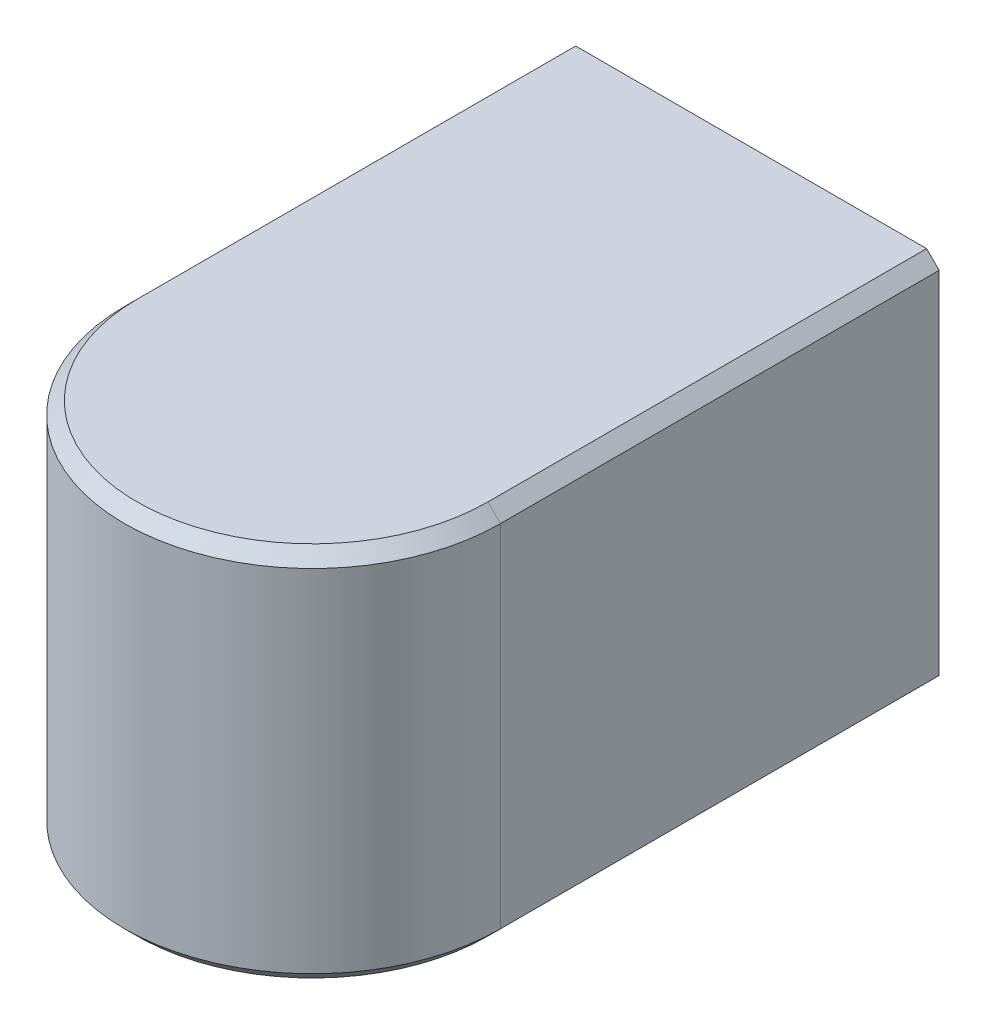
ISO-10303-21;
HEADER;
FILE_DESCRIPTION(('STEP AP214'),'2;1');
FILE_NAME('part.step','',(''),(''),'','','');
FILE_SCHEMA(('AUTOMOTIVE_DESIGN { 1 0 10303 214 1 1 1 1 }'));
ENDSEC;
DATA;
#1=APPLICATION_CONTEXT('core data for automotive mechanical design processes');
#2=APPLICATION_PROTOCOL_DEFINITION('international standard','automotive_design',2000,#1);
#3=PRODUCT_CONTEXT('',#1,'mechanical');
#4=PRODUCT('Part','Part','',(#3));
#5=PRODUCT_RELATED_PRODUCT_CATEGORY('part','',(#4));
#6=PRODUCT_DEFINITION_FORMATION('','',#4);
#7=PRODUCT_DEFINITION_CONTEXT('part definition',#1,'design');
#8=PRODUCT_DEFINITION('design','',#6,#7);
#9=PRODUCT_DEFINITION_SHAPE('','',#8);
#10=(LENGTH_UNIT() NAMED_UNIT(*) SI_UNIT(.MILLI.,.METRE.));
#11=(NAMED_UNIT(*) PLANE_ANGLE_UNIT() SI_UNIT($,.RADIAN.));
#12=(NAMED_UNIT(*) SI_UNIT($,.STERADIAN.) SOLID_ANGLE_UNIT());
#13=UNCERTAINTY_MEASURE_WITH_UNIT(LENGTH_MEASURE(1.E-05),#10,'distance_accuracy_value','');
#14=(GEOMETRIC_REPRESENTATION_CONTEXT(3) GLOBAL_UNCERTAINTY_ASSIGNED_CONTEXT((#13)) GLOBAL_UNIT_ASSIGNED_CONTEXT((#10,
#11,#12)) REPRESENTATION_CONTEXT('',''));
#15=CARTESIAN_POINT('',(0.,0.,0.));
#16=DIRECTION('',(0.,0.,1.));
#17=DIRECTION('',(1.,0.,0.));
#18=AXIS2_PLACEMENT_3D('',#15,#16,#17);
#19=CARTESIAN_POINT('',(-3.,-3.,3.5));
#20=DIRECTION('',(1.,0.,0.));
#21=DIRECTION('',(0.,0.,-1.));
#22=AXIS2_PLACEMENT_3D('',#19,#20,#21);
#23=PLANE('',#22);
#24=DIRECTION('',(0.,-1.,0.));
#25=VECTOR('',#24,1.);
#26=CARTESIAN_POINT('',(-3.,-3.,-3.5));
#27=LINE('',#26,#25);
#28=CARTESIAN_POINT('',(-3.,2.8,-3.5));
#29=VERTEX_POINT('',#28);
#30=CARTESIAN_POINT('',(-3.,-2.8,-3.5));
#31=VERTEX_POINT('',#30);
#32=EDGE_CURVE('E173',#29,#31,#27,.T.);
#33=ORIENTED_EDGE('',*,*,#32,.T.);
#34=DIRECTION('',(0.,0.,1.));
#35=VECTOR('',#34,1.);
#36=CARTESIAN_POINT('',(-3.,-2.8,3.5));
#37=LINE('',#36,#35);
#38=CARTESIAN_POINT('',(-3.,-2.8,3.5));
#39=VERTEX_POINT('',#38);
#40=EDGE_CURVE('E11',#31,#39,#37,.T.);
#41=ORIENTED_EDGE('',*,*,#40,.T.);
#42=DIRECTION('',(0.,-1.,0.));
#43=VECTOR('',#42,1.);
#44=CARTESIAN_POINT('',(-3.,-3.,3.5));
#45=LINE('',#44,#43);
#46=CARTESIAN_POINT('',(-3.,2.8,3.5));
#47=VERTEX_POINT('',#46);
#48=EDGE_CURVE('E120',#47,#39,#45,.T.);
#49=ORIENTED_EDGE('',*,*,#48,.F.);
#50=DIRECTION('',(0.,0.,-1.));
#51=VECTOR('',#50,1.);
#52=CARTESIAN_POINT('',(-3.,2.8,3.5));
#53=LINE('',#52,#51);
#54=EDGE_CURVE('E137',#47,#29,#53,.T.);
#55=ORIENTED_EDGE('',*,*,#54,.T.);
#56=EDGE_LOOP('',(#33,#41,#49,#55));
#57=FACE_BOUND('',#56,.T.);
#58=ADVANCED_FACE('F30',(#57),#23,.F.);
#59=CARTESIAN_POINT('',(-3.,-3.,3.5));
#60=DIRECTION('',(0.,1.,0.));
#61=DIRECTION('',(0.,0.,1.));
#62=AXIS2_PLACEMENT_3D('',#59,#60,#61);
#63=PLANE('',#62);
#64=DIRECTION('',(1.,0.,0.));
#65=VECTOR('',#64,1.);
#66=CARTESIAN_POINT('',(-3.,-3.,-3.5));
#67=LINE('',#66,#65);
#68=CARTESIAN_POINT('',(-2.8,-3.,-3.5));
#69=VERTEX_POINT('',#68);
#70=CARTESIAN_POINT('',(2.8,-3.,-3.5));
#71=VERTEX_POINT('',#70);
#72=EDGE_CURVE('E125',#69,#71,#67,.T.);
#73=ORIENTED_EDGE('',*,*,#72,.T.);
#74=DIRECTION('',(0.,0.,1.));
#75=VECTOR('',#74,1.);
#76=CARTESIAN_POINT('',(2.8,-3.,3.5));
#77=LINE('',#76,#75);
#78=CARTESIAN_POINT('',(2.8,-3.,3.5));
#79=VERTEX_POINT('',#78);
#80=EDGE_CURVE('E50',#71,#79,#77,.T.);
#81=ORIENTED_EDGE('',*,*,#80,.T.);
#82=CARTESIAN_POINT('',(0.,-3.,3.5));
#83=DIRECTION('',(0.,1.,0.));
#84=DIRECTION('',(0.,0.,1.));
#85=AXIS2_PLACEMENT_3D('',#82,#83,#84);
#86=CIRCLE('',#85,2.8);
#87=CARTESIAN_POINT('',(-2.8,-3.,3.5));
#88=VERTEX_POINT('',#87);
#89=EDGE_CURVE('E148',#79,#88,#86,.F.);
#90=ORIENTED_EDGE('',*,*,#89,.T.);
#91=DIRECTION('',(0.,0.,-1.));
#92=VECTOR('',#91,1.);
#93=CARTESIAN_POINT('',(-2.8,-3.,3.5));
#94=LINE('',#93,#92);
#95=EDGE_CURVE('E146',#88,#69,#94,.T.);
#96=ORIENTED_EDGE('',*,*,#95,.T.);
#97=EDGE_LOOP('',(#73,#81,#90,#96));
#98=FACE_BOUND('',#97,.T.);
#99=ADVANCED_FACE('F171',(#98),#63,.F.);
#100=CARTESIAN_POINT('',(3.,-3.,3.5));
#101=DIRECTION('',(-1.,0.,0.));
#102=DIRECTION('',(0.,0.,1.));
#103=AXIS2_PLACEMENT_3D('',#100,#101,#102);
#104=PLANE('',#103);
#105=DIRECTION('',(0.,1.,0.));
#106=VECTOR('',#105,1.);
#107=CARTESIAN_POINT('',(3.,-3.,3.5));
#108=LINE('',#107,#106);
#109=CARTESIAN_POINT('',(3.,-2.8,3.5));
#110=VERTEX_POINT('',#109);
#111=CARTESIAN_POINT('',(3.,2.8,3.5));
#112=VERTEX_POINT('',#111);
#113=EDGE_CURVE('E123',#110,#112,#108,.T.);
#114=ORIENTED_EDGE('',*,*,#113,.F.);
#115=DIRECTION('',(0.,0.,-1.));
#116=VECTOR('',#115,1.);
#117=CARTESIAN_POINT('',(3.,-2.8,3.5));
#118=LINE('',#117,#116);
#119=CARTESIAN_POINT('',(3.,-2.8,-3.5));
#120=VERTEX_POINT('',#119);
#121=EDGE_CURVE('E139',#110,#120,#118,.T.);
#122=ORIENTED_EDGE('',*,*,#121,.T.);
#123=DIRECTION('',(0.,1.,0.));
#124=VECTOR('',#123,1.);
#125=CARTESIAN_POINT('',(3.,-3.,-3.5));
#126=LINE('',#125,#124);
#127=CARTESIAN_POINT('',(3.,2.8,-3.5));
#128=VERTEX_POINT('',#127);
#129=EDGE_CURVE('E121',#120,#128,#126,.T.);
#130=ORIENTED_EDGE('',*,*,#129,.T.);
#131=DIRECTION('',(0.,0.,1.));
#132=VECTOR('',#131,1.);
#133=CARTESIAN_POINT('',(3.,2.8,3.5));
#134=LINE('',#133,#132);
#135=EDGE_CURVE('E102',#128,#112,#134,.T.);
#136=ORIENTED_EDGE('',*,*,#135,.T.);
#137=EDGE_LOOP('',(#114,#122,#130,#136));
#138=FACE_BOUND('',#137,.T.);
#139=ADVANCED_FACE('F159',(#138),#104,.F.);
#140=CARTESIAN_POINT('',(-3.,3.,3.5));
#141=DIRECTION('',(0.,-1.,0.));
#142=DIRECTION('',(0.,0.,-1.));
#143=AXIS2_PLACEMENT_3D('',#140,#141,#142);
#144=PLANE('',#143);
#145=CARTESIAN_POINT('',(0.,3.,3.5));
#146=DIRECTION('',(0.,-1.,0.));
#147=DIRECTION('',(0.,0.,-1.));
#148=AXIS2_PLACEMENT_3D('',#145,#146,#147);
#149=CIRCLE('',#148,2.8);
#150=CARTESIAN_POINT('',(-2.8,3.,3.5));
#151=VERTEX_POINT('',#150);
#152=CARTESIAN_POINT('',(2.8,3.,3.5));
#153=VERTEX_POINT('',#152);
#154=EDGE_CURVE('E114',#151,#153,#149,.F.);
#155=ORIENTED_EDGE('',*,*,#154,.T.);
#156=DIRECTION('',(0.,0.,-1.));
#157=VECTOR('',#156,1.);
#158=CARTESIAN_POINT('',(2.8,3.,3.5));
#159=LINE('',#158,#157);
#160=CARTESIAN_POINT('',(2.8,3.,-3.5));
#161=VERTEX_POINT('',#160);
#162=EDGE_CURVE('E100',#153,#161,#159,.T.);
#163=ORIENTED_EDGE('',*,*,#162,.T.);
#164=DIRECTION('',(-1.,0.,0.));
#165=VECTOR('',#164,1.);
#166=CARTESIAN_POINT('',(-3.,3.,-3.5));
#167=LINE('',#166,#165);
#168=CARTESIAN_POINT('',(-2.8,3.,-3.5));
#169=VERTEX_POINT('',#168);
#170=EDGE_CURVE('E111',#161,#169,#167,.T.);
#171=ORIENTED_EDGE('',*,*,#170,.T.);
#172=DIRECTION('',(0.,0.,1.));
#173=VECTOR('',#172,1.);
#174=CARTESIAN_POINT('',(-2.8,3.,3.5));
#175=LINE('',#174,#173);
#176=EDGE_CURVE('E130',#169,#151,#175,.T.);
#177=ORIENTED_EDGE('',*,*,#176,.T.);
#178=EDGE_LOOP('',(#155,#163,#171,#177));
#179=FACE_BOUND('',#178,.T.);
#180=ADVANCED_FACE('F110',(#179),#144,.F.);
#181=CARTESIAN_POINT('',(-3.,3.,-3.5));
#182=DIRECTION('',(0.,0.,-1.));
#183=DIRECTION('',(-1.,0.,0.));
#184=AXIS2_PLACEMENT_3D('',#181,#182,#183);
#185=PLANE('',#184);
#186=ORIENTED_EDGE('',*,*,#129,.F.);
#187=DIRECTION('',(0.707106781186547,0.707106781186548,0.));
#188=VECTOR('',#187,1.);
#189=CARTESIAN_POINT('',(2.90000000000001,-2.89999999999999,-3.5));
#190=LINE('',#189,#188);
#191=EDGE_CURVE('E144',#120,#71,#190,.F.);
#192=ORIENTED_EDGE('',*,*,#191,.T.);
#193=ORIENTED_EDGE('',*,*,#72,.F.);
#194=DIRECTION('',(0.707106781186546,-0.707106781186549,0.));
#195=VECTOR('',#194,1.);
#196=CARTESIAN_POINT('',(-5.9,0.100000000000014,-3.5));
#197=LINE('',#196,#195);
#198=EDGE_CURVE('E142',#69,#31,#197,.F.);
#199=ORIENTED_EDGE('',*,*,#198,.T.);
#200=ORIENTED_EDGE('',*,*,#32,.F.);
#201=DIRECTION('',(-0.707106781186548,-0.707106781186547,0.));
#202=VECTOR('',#201,1.);
#203=CARTESIAN_POINT('',(-2.9,2.9,-3.5));
#204=LINE('',#203,#202);
#205=EDGE_CURVE('E106',#29,#169,#204,.F.);
#206=ORIENTED_EDGE('',*,*,#205,.T.);
#207=ORIENTED_EDGE('',*,*,#170,.F.);
#208=DIRECTION('',(-0.707106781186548,0.707106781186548,0.));
#209=VECTOR('',#208,1.);
#210=CARTESIAN_POINT('',(-0.1,5.9,-3.5));
#211=LINE('',#210,#209);
#212=EDGE_CURVE('E96',#161,#128,#211,.F.);
#213=ORIENTED_EDGE('',*,*,#212,.T.);
#214=EDGE_LOOP('',(#186,#192,#193,#199,#200,#206,#207,#213));
#215=FACE_BOUND('',#214,.T.);
#216=ADVANCED_FACE('F117',(#215),#185,.T.);
#217=CARTESIAN_POINT('',(0.,-3.,3.5));
#218=DIRECTION('',(0.,1.,0.));
#219=DIRECTION('',(0.,0.,1.));
#220=AXIS2_PLACEMENT_3D('',#217,#218,#219);
#221=CYLINDRICAL_SURFACE('',#220,3.);
#222=ORIENTED_EDGE('',*,*,#48,.T.);
#223=CARTESIAN_POINT('',(0.,-2.8,3.5));
#224=DIRECTION('',(0.,1.,0.));
#225=DIRECTION('',(0.,0.,1.));
#226=AXIS2_PLACEMENT_3D('',#223,#224,#225);
#227=CIRCLE('',#226,3.);
#228=EDGE_CURVE('E37',#39,#110,#227,.T.);
#229=ORIENTED_EDGE('',*,*,#228,.T.);
#230=ORIENTED_EDGE('',*,*,#113,.T.);
#231=CARTESIAN_POINT('',(0.,2.8,3.5));
#232=DIRECTION('',(0.,-1.,0.));
#233=DIRECTION('',(0.,0.,-1.));
#234=AXIS2_PLACEMENT_3D('',#231,#232,#233);
#235=CIRCLE('',#234,3.);
#236=EDGE_CURVE('E135',#112,#47,#235,.T.);
#237=ORIENTED_EDGE('',*,*,#236,.T.);
#238=EDGE_LOOP('',(#222,#229,#230,#237));
#239=FACE_BOUND('',#238,.T.);
#240=ADVANCED_FACE('F153',(#239),#221,.T.);
#241=CARTESIAN_POINT('',(-3.,2.8,3.5));
#242=DIRECTION('',(0.707106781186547,-0.707106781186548,0.));
#243=DIRECTION('',(0.707106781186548,0.707106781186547,0.));
#244=AXIS2_PLACEMENT_3D('',#241,#242,#243);
#245=PLANE('',#244);
#246=ORIENTED_EDGE('',*,*,#205,.F.);
#247=ORIENTED_EDGE('',*,*,#54,.F.);
#248=DIRECTION('',(-0.707106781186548,-0.707106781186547,0.));
#249=VECTOR('',#248,1.);
#250=CARTESIAN_POINT('',(-2.8,3.,3.5));
#251=LINE('',#250,#249);
#252=EDGE_CURVE('E174',#151,#47,#251,.T.);
#253=ORIENTED_EDGE('',*,*,#252,.F.);
#254=ORIENTED_EDGE('',*,*,#176,.F.);
#255=EDGE_LOOP('',(#246,#247,#253,#254));
#256=FACE_BOUND('',#255,.T.);
#257=ADVANCED_FACE('F186',(#256),#245,.F.);
#258=CARTESIAN_POINT('',(0.,3.,3.5));
#259=DIRECTION('',(0.,-1.,0.));
#260=DIRECTION('',(0.,0.,-1.));
#261=AXIS2_PLACEMENT_3D('',#258,#259,#260);
#262=CONICAL_SURFACE('',#261,2.8,0.785398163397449);
#263=ORIENTED_EDGE('',*,*,#252,.T.);
#264=ORIENTED_EDGE('',*,*,#236,.F.);
#265=DIRECTION('',(0.707106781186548,-0.707106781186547,0.));
#266=VECTOR('',#265,1.);
#267=CARTESIAN_POINT('',(2.8,3.,3.5));
#268=LINE('',#267,#266);
#269=EDGE_CURVE('E179',#153,#112,#268,.T.);
#270=ORIENTED_EDGE('',*,*,#269,.F.);
#271=ORIENTED_EDGE('',*,*,#154,.F.);
#272=EDGE_LOOP('',(#263,#264,#270,#271));
#273=FACE_BOUND('',#272,.T.);
#274=ADVANCED_FACE('F188',(#273),#262,.T.);
#275=CARTESIAN_POINT('',(2.8,3.,3.5));
#276=DIRECTION('',(-0.707106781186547,-0.707106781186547,0.));
#277=DIRECTION('',(0.707106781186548,-0.707106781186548,0.));
#278=AXIS2_PLACEMENT_3D('',#275,#276,#277);
#279=PLANE('',#278);
#280=ORIENTED_EDGE('',*,*,#269,.T.);
#281=ORIENTED_EDGE('',*,*,#135,.F.);
#282=ORIENTED_EDGE('',*,*,#212,.F.);
#283=ORIENTED_EDGE('',*,*,#162,.F.);
#284=EDGE_LOOP('',(#280,#281,#282,#283));
#285=FACE_BOUND('',#284,.T.);
#286=ADVANCED_FACE('F99',(#285),#279,.F.);
#287=CARTESIAN_POINT('',(-2.8,-3.,3.5));
#288=DIRECTION('',(0.707106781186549,0.707106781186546,0.));
#289=DIRECTION('',(-0.707106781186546,0.707106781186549,0.));
#290=AXIS2_PLACEMENT_3D('',#287,#288,#289);
#291=PLANE('',#290);
#292=ORIENTED_EDGE('',*,*,#198,.F.);
#293=ORIENTED_EDGE('',*,*,#95,.F.);
#294=DIRECTION('',(0.707106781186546,-0.707106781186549,0.));
#295=VECTOR('',#294,1.);
#296=CARTESIAN_POINT('',(-3.,-2.8,3.5));
#297=LINE('',#296,#295);
#298=EDGE_CURVE('E166',#39,#88,#297,.T.);
#299=ORIENTED_EDGE('',*,*,#298,.F.);
#300=ORIENTED_EDGE('',*,*,#40,.F.);
#301=EDGE_LOOP('',(#292,#293,#299,#300));
#302=FACE_BOUND('',#301,.T.);
#303=ADVANCED_FACE('F182',(#302),#291,.F.);
#304=CARTESIAN_POINT('',(0.,-2.8,3.5));
#305=DIRECTION('',(0.,1.,0.));
#306=DIRECTION('',(0.,0.,1.));
#307=AXIS2_PLACEMENT_3D('',#304,#305,#306);
#308=CONICAL_SURFACE('',#307,3.,0.785398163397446);
#309=ORIENTED_EDGE('',*,*,#298,.T.);
#310=ORIENTED_EDGE('',*,*,#89,.F.);
#311=DIRECTION('',(-0.707106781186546,-0.707106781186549,0.));
#312=VECTOR('',#311,1.);
#313=CARTESIAN_POINT('',(3.,-2.8,3.5));
#314=LINE('',#313,#312);
#315=EDGE_CURVE('E163',#110,#79,#314,.T.);
#316=ORIENTED_EDGE('',*,*,#315,.F.);
#317=ORIENTED_EDGE('',*,*,#228,.F.);
#318=EDGE_LOOP('',(#309,#310,#316,#317));
#319=FACE_BOUND('',#318,.T.);
#320=ADVANCED_FACE('F164',(#319),#308,.T.);
#321=CARTESIAN_POINT('',(3.,-2.8,3.5));
#322=DIRECTION('',(-0.707106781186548,0.707106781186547,0.));
#323=DIRECTION('',(-0.707106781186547,-0.707106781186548,0.));
#324=AXIS2_PLACEMENT_3D('',#321,#322,#323);
#325=PLANE('',#324);
#326=ORIENTED_EDGE('',*,*,#315,.T.);
#327=ORIENTED_EDGE('',*,*,#80,.F.);
#328=ORIENTED_EDGE('',*,*,#191,.F.);
#329=ORIENTED_EDGE('',*,*,#121,.F.);
#330=EDGE_LOOP('',(#326,#327,#328,#329));
#331=FACE_BOUND('',#330,.T.);
#332=ADVANCED_FACE('F168',(#331),#325,.F.);
#333=CLOSED_SHELL('',(#58,#99,#139,#180,#216,#240,#257,#274,#286,#303,#320,#332));
#334=MANIFOLD_SOLID_BREP('B2',#333);
#335=ADVANCED_BREP_SHAPE_REPRESENTATION('',(#18,#334),#14);
#336=SHAPE_DEFINITION_REPRESENTATION(#9,#335);
ENDSEC;
END-ISO-10303-21;
